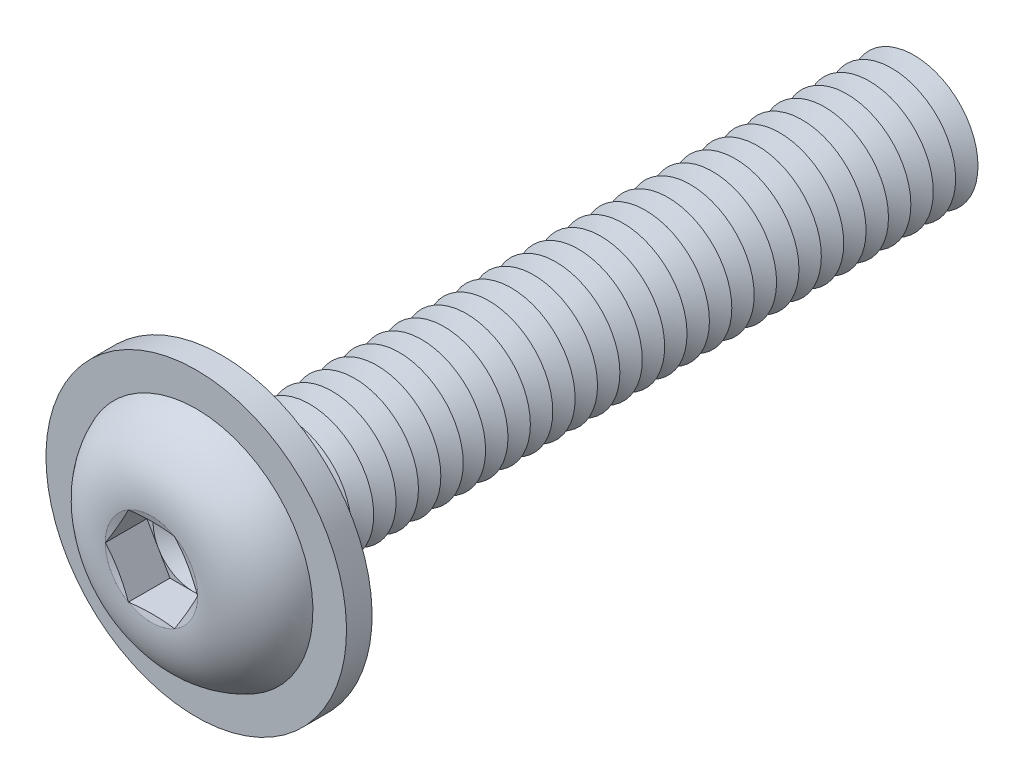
from build123d import *

# Parameters (mm, degrees)
FILLET1_R           = 0.35
LPATTERN1_COUNT     = 31
LPATTERN1_PITCH     = 0.7
CUT_EXTRUDE1_DEPTH  = 1.3
SKETCH5_R           = 4.7
SKETCH5_R_2         = 2.35
BOSS_EXTRUDE1_DEPTH = 0.8


with BuildPart() as part:
    # Sketch1 → Revolve1 (revolve)
    with BuildSketch(Plane(origin=(0, 0, 0), x_dir=(0, 0, -1), z_dir=(1, 0, 0)), mode=Mode.PRIVATE) as revolve1_sk:
        with BuildLine():
            Line((0, 2), (0, 3.8))
            ThreePointArc((0, 3.8), (-1.611961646, 3.099623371), (-2.2, 1.443375))
            Line((-2.2, 1.443375), (-2.006624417, 0.7216875))
            Line((-2.006624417, 0.7216875), (-2.2, 0.7216875))
            Line((-2.2, 0.7216875), (-2.2, 0))
            Line((-2.2, 0), (22, 0))
            Line((22, 0), (22, 2))
            Line((22, 2), (0, 2))
        make_face()
    revolve(revolve1_sk.sketch.rotate(Axis((0, 0, -22), (0, 0, 1)), 90), axis=Axis((0, 0, -22), (0, 0, 1)))

    # Fillet1
    fillet1_edges = [part.edges().sort_by_distance(p)[0] for p in [
        (2, 0, 0),
    ]]
    fillet(fillet1_edges, radius=FILLET1_R)

    # Sketch2 → Cut-Revolve1 (revolve, cut)
    with BuildSketch(Plane(origin=(0, 0, 0), x_dir=(0, 0, -1), z_dir=(1, 0, 0)), mode=Mode.PRIVATE) as cut_revolve1_sk:
        Polygon((21.65, 2), (22.35, 2), (22, 1.393782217), align=None)
    cut_revolve1 = revolve(cut_revolve1_sk.sketch.rotate(Axis((0, 0, -22), (0, 0, -1)), 270), axis=Axis((0, 0, -22), (0, 0, -1)), mode=Mode.SUBTRACT)

    # LPattern1: Cut-Revolve1 ×31
    with Locations(*[(0, 0, i * LPATTERN1_PITCH) for i in range(1, LPATTERN1_COUNT)]):
        add(cut_revolve1, mode=Mode.SUBTRACT)

    # Sketch3 → Cut-Extrude1 (cut)
    with BuildSketch(Plane.XY.offset(2.2)):
        Polygon((0.7216875, 1.249999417), (-0.7216875, 1.249999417), (-1.443375, 0), (-0.7216875, -1.249999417), (0.7216875, -1.249999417), (1.443375, 0), align=None)
    extrude(amount=-CUT_EXTRUDE1_DEPTH, mode=Mode.SUBTRACT)

    # Cut-Extrude2 cone 1 section (on through the dimple's axis) → Cut-Extrude2 (revolve, cut)
    with BuildSketch(Plane(origin=(0, 0, 0.9), x_dir=(0, -1, 0), z_dir=(1, 0, 0))):
        Polygon((0, 0), (1.249999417, 0), (0, 0.7216875), align=None)
    revolve(axis=Axis((0, 0, 0.9), (0, 0, -1)), mode=Mode.SUBTRACT)

    # Sketch5 → Boss-Extrude1 (add)
    with BuildSketch(Plane(origin=(0, 0, 0), x_dir=(-1, 0, 0), z_dir=(0, 0, -1))):
        with Locations(Location((0, 0, 0), (0, 0, 90))):
            Circle(SKETCH5_R)
        Circle(SKETCH5_R_2, mode=Mode.SUBTRACT)
    extrude(amount=-BOSS_EXTRUDE1_DEPTH)


solid = part.part
